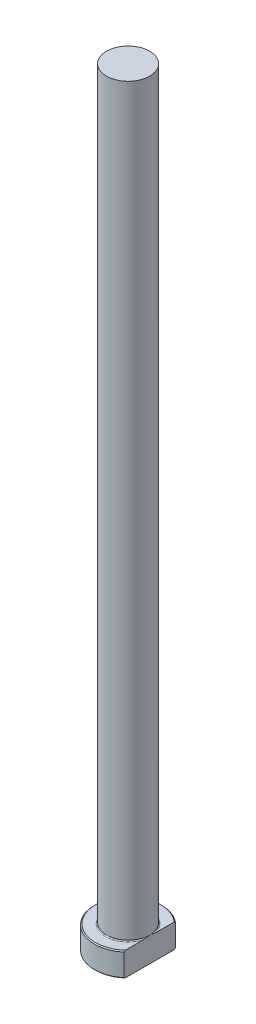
ISO-10303-21;
HEADER;
FILE_DESCRIPTION(('STEP AP214'),'2;1');
FILE_NAME('part.step','',(''),(''),'','','');
FILE_SCHEMA(('AUTOMOTIVE_DESIGN { 1 0 10303 214 1 1 1 1 }'));
ENDSEC;
DATA;
#1=APPLICATION_CONTEXT('core data for automotive mechanical design processes');
#2=APPLICATION_PROTOCOL_DEFINITION('international standard','automotive_design',2000,#1);
#3=PRODUCT_CONTEXT('',#1,'mechanical');
#4=PRODUCT('Part','Part','',(#3));
#5=PRODUCT_RELATED_PRODUCT_CATEGORY('part','',(#4));
#6=PRODUCT_DEFINITION_FORMATION('','',#4);
#7=PRODUCT_DEFINITION_CONTEXT('part definition',#1,'design');
#8=PRODUCT_DEFINITION('design','',#6,#7);
#9=PRODUCT_DEFINITION_SHAPE('','',#8);
#10=(LENGTH_UNIT() NAMED_UNIT(*) SI_UNIT(.MILLI.,.METRE.));
#11=(NAMED_UNIT(*) PLANE_ANGLE_UNIT() SI_UNIT($,.RADIAN.));
#12=(NAMED_UNIT(*) SI_UNIT($,.STERADIAN.) SOLID_ANGLE_UNIT());
#13=UNCERTAINTY_MEASURE_WITH_UNIT(LENGTH_MEASURE(1.E-05),#10,'distance_accuracy_value','');
#14=(GEOMETRIC_REPRESENTATION_CONTEXT(3) GLOBAL_UNCERTAINTY_ASSIGNED_CONTEXT((#13)) GLOBAL_UNIT_ASSIGNED_CONTEXT((#10,
#11,#12)) REPRESENTATION_CONTEXT('',''));
#15=CARTESIAN_POINT('',(0.,0.,0.));
#16=DIRECTION('',(0.,0.,1.));
#17=DIRECTION('',(1.,0.,0.));
#18=AXIS2_PLACEMENT_3D('',#15,#16,#17);
#19=CARTESIAN_POINT('',(0.,0.,0.));
#20=DIRECTION('',(0.,-1.,0.));
#21=DIRECTION('',(0.,0.,-1.));
#22=AXIS2_PLACEMENT_3D('',#19,#20,#21);
#23=PLANE('',#22);
#24=CARTESIAN_POINT('',(0.,0.,0.));
#25=DIRECTION('',(0.,-1.,0.));
#26=DIRECTION('',(0.,0.,-1.));
#27=AXIS2_PLACEMENT_3D('',#24,#25,#26);
#28=CIRCLE('',#27,6.79999999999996);
#29=CARTESIAN_POINT('',(4.49999999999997,0.,5.09803883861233));
#30=VERTEX_POINT('',#29);
#31=CARTESIAN_POINT('',(4.49999999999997,0.,-5.09803883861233));
#32=VERTEX_POINT('',#31);
#33=EDGE_CURVE('E98',#30,#32,#28,.T.);
#34=ORIENTED_EDGE('',*,*,#33,.T.);
#35=DIRECTION('',(0.,0.,1.));
#36=VECTOR('',#35,1.);
#37=CARTESIAN_POINT('',(4.49999999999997,0.,-5.36190264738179));
#38=LINE('',#37,#36);
#39=EDGE_CURVE('E83',#32,#30,#38,.T.);
#40=ORIENTED_EDGE('',*,*,#39,.T.);
#41=EDGE_LOOP('',(#34,#40));
#42=FACE_BOUND('',#41,.T.);
#43=ADVANCED_FACE('F32',(#42),#23,.T.);
#44=CARTESIAN_POINT('',(0.,259.958771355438,0.));
#45=DIRECTION('',(0.,1.,0.));
#46=DIRECTION('',(0.,0.,1.));
#47=AXIS2_PLACEMENT_3D('',#44,#45,#46);
#48=CYLINDRICAL_SURFACE('',#47,6.99999999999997);
#49=CARTESIAN_POINT('',(0.,4.80000000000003,0.));
#50=DIRECTION('',(0.,1.,0.));
#51=DIRECTION('',(0.,0.,1.));
#52=AXIS2_PLACEMENT_3D('',#49,#50,#51);
#53=CIRCLE('',#52,6.99999999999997);
#54=CARTESIAN_POINT('',(4.49999999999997,4.80000000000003,5.36190264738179));
#55=VERTEX_POINT('',#54);
#56=CARTESIAN_POINT('',(4.49999999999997,4.80000000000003,-5.36190264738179));
#57=VERTEX_POINT('',#56);
#58=EDGE_CURVE('E104',#55,#57,#53,.F.);
#59=ORIENTED_EDGE('',*,*,#58,.T.);
#60=DIRECTION('',(0.,-1.,0.));
#61=VECTOR('',#60,1.);
#62=CARTESIAN_POINT('',(4.49999999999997,160.,-5.36190264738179));
#63=LINE('',#62,#61);
#64=CARTESIAN_POINT('',(4.49999999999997,0.200000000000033,-5.36190264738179));
#65=VERTEX_POINT('',#64);
#66=EDGE_CURVE('E183',#57,#65,#63,.T.);
#67=ORIENTED_EDGE('',*,*,#66,.T.);
#68=CARTESIAN_POINT('',(0.,0.200000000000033,0.));
#69=DIRECTION('',(0.,-1.,0.));
#70=DIRECTION('',(0.,0.,-1.));
#71=AXIS2_PLACEMENT_3D('',#68,#69,#70);
#72=CIRCLE('',#71,6.99999999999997);
#73=CARTESIAN_POINT('',(4.49999999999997,0.200000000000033,5.36190264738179));
#74=VERTEX_POINT('',#73);
#75=EDGE_CURVE('E100',#65,#74,#72,.F.);
#76=ORIENTED_EDGE('',*,*,#75,.T.);
#77=DIRECTION('',(0.,-1.,0.));
#78=VECTOR('',#77,1.);
#79=CARTESIAN_POINT('',(4.49999999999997,160.,5.36190264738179));
#80=LINE('',#79,#78);
#81=EDGE_CURVE('E93',#55,#74,#80,.T.);
#82=ORIENTED_EDGE('',*,*,#81,.F.);
#83=EDGE_LOOP('',(#59,#67,#76,#82));
#84=FACE_BOUND('',#83,.T.);
#85=ADVANCED_FACE('F158',(#84),#48,.T.);
#86=CARTESIAN_POINT('',(-6.99999999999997,5.,0.));
#87=DIRECTION('',(0.,1.,0.));
#88=DIRECTION('',(0.,0.,1.));
#89=AXIS2_PLACEMENT_3D('',#86,#87,#88);
#90=PLANE('',#89);
#91=CARTESIAN_POINT('',(0.,5.,0.));
#92=DIRECTION('',(0.,1.,0.));
#93=DIRECTION('',(0.,0.,1.));
#94=AXIS2_PLACEMENT_3D('',#91,#92,#93);
#95=CIRCLE('',#94,6.80000000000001);
#96=CARTESIAN_POINT('',(4.49999999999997,5.,-5.09803883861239));
#97=VERTEX_POINT('',#96);
#98=CARTESIAN_POINT('',(4.49999999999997,5.,5.09803883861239));
#99=VERTEX_POINT('',#98);
#100=EDGE_CURVE('E178',#97,#99,#95,.T.);
#101=ORIENTED_EDGE('',*,*,#100,.T.);
#102=DIRECTION('',(0.,0.,-1.));
#103=VECTOR('',#102,1.);
#104=CARTESIAN_POINT('',(4.49999999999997,5.,0.));
#105=LINE('',#104,#103);
#106=CARTESIAN_POINT('',(4.49999999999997,4.99999999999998,1.35646599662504));
#107=VERTEX_POINT('',#106);
#108=EDGE_CURVE('E57',#99,#107,#105,.T.);
#109=ORIENTED_EDGE('',*,*,#108,.T.);
#110=CARTESIAN_POINT('',(0.,5.,0.));
#111=DIRECTION('',(0.,1.,0.));
#112=DIRECTION('',(0.,0.,1.));
#113=AXIS2_PLACEMENT_3D('',#110,#111,#112);
#114=CIRCLE('',#113,4.69999999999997);
#115=CARTESIAN_POINT('',(4.49999999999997,4.99999999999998,-1.35646599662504));
#116=VERTEX_POINT('',#115);
#117=EDGE_CURVE('E107',#107,#116,#114,.F.);
#118=ORIENTED_EDGE('',*,*,#117,.T.);
#119=EDGE_CURVE('E136',#116,#97,#105,.T.);
#120=ORIENTED_EDGE('',*,*,#119,.T.);
#121=EDGE_LOOP('',(#101,#109,#118,#120));
#122=FACE_BOUND('',#121,.T.);
#123=ADVANCED_FACE('F147',(#122),#90,.T.);
#124=CARTESIAN_POINT('',(0.,5.,0.));
#125=DIRECTION('',(0.,-1.,0.));
#126=DIRECTION('',(0.,0.,-1.));
#127=AXIS2_PLACEMENT_3D('',#124,#125,#126);
#128=CONICAL_SURFACE('',#127,6.8,0.785398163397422);
#129=ORIENTED_EDGE('',*,*,#58,.F.);
#130=CARTESIAN_POINT('',(4.49999999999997,-0.826603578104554,11.7975047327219));
#131=CARTESIAN_POINT('',(4.49999999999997,-0.656533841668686,11.6154797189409));
#132=CARTESIAN_POINT('',(4.49999999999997,-0.486727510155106,11.4332086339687));
#133=CARTESIAN_POINT('',(4.49999999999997,-0.147726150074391,11.0680967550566));
#134=CARTESIAN_POINT('',(4.49999999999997,0.0214688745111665,10.8852559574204));
#135=CARTESIAN_POINT('',(4.49999999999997,0.528086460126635,10.3356799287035));
#136=CARTESIAN_POINT('',(4.49999999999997,0.864461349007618,9.96797672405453));
#137=CARTESIAN_POINT('',(4.49999999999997,1.53592421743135,9.22638843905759));
#138=CARTESIAN_POINT('',(4.49999999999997,1.87098392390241,8.85247771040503));
#139=CARTESIAN_POINT('',(4.49999999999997,2.53567264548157,8.09993899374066));
#140=CARTESIAN_POINT('',(4.49999999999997,2.86530243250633,7.72131168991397));
#141=CARTESIAN_POINT('',(4.49999999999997,3.45461987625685,7.03004475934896));
#142=CARTESIAN_POINT('',(4.49999999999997,3.71567058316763,6.71857295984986));
#143=CARTESIAN_POINT('',(4.49999999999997,4.10171222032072,6.24673895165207));
#144=CARTESIAN_POINT('',(4.49999999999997,4.22949330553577,6.08866046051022));
#145=CARTESIAN_POINT('',(4.49999999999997,4.48278285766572,5.77069538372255));
#146=CARTESIAN_POINT('',(4.49999999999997,4.6082913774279,5.61080884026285));
#147=CARTESIAN_POINT('',(4.49999999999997,4.85630566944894,5.28917357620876));
#148=CARTESIAN_POINT('',(4.49999999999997,4.97881640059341,5.12742868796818));
#149=CARTESIAN_POINT('',(4.49999999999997,5.22038566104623,4.80138722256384));
#150=CARTESIAN_POINT('',(4.49999999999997,5.33944438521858,4.63709079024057));
#151=CARTESIAN_POINT('',(4.49999999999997,5.57315514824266,4.3055112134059));
#152=CARTESIAN_POINT('',(4.49999999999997,5.6878094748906,4.13822968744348));
#153=CARTESIAN_POINT('',(4.49999999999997,5.91154779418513,3.79999593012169));
#154=CARTESIAN_POINT('',(4.49999999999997,6.02063265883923,3.6290442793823));
#155=CARTESIAN_POINT('',(4.49999999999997,6.21658595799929,3.30732260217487));
#156=CARTESIAN_POINT('',(4.49999999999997,6.30440873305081,3.15713645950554));
#157=CARTESIAN_POINT('',(4.49999999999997,6.47332532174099,2.85297503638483));
#158=CARTESIAN_POINT('',(4.49999999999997,6.55441838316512,2.69899933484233));
#159=CARTESIAN_POINT('',(4.49999999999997,6.70797622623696,2.38687180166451));
#160=CARTESIAN_POINT('',(4.49999999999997,6.78044573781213,2.22872231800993));
#161=CARTESIAN_POINT('',(4.49999999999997,6.91445119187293,1.90783021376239));
#162=CARTESIAN_POINT('',(4.49999999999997,6.97598991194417,1.74508877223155));
#163=CARTESIAN_POINT('',(4.49999999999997,7.07411688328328,1.44888794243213));
#164=CARTESIAN_POINT('',(4.49999999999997,7.11323376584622,1.31627139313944));
#165=CARTESIAN_POINT('',(4.49999999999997,7.18128524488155,1.04846462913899));
#166=CARTESIAN_POINT('',(4.49999999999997,7.21022354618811,0.913275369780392));
#167=CARTESIAN_POINT('',(4.49999999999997,7.2564961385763,0.641333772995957));
#168=CARTESIAN_POINT('',(4.49999999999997,7.27386660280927,0.504587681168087));
#169=CARTESIAN_POINT('',(4.49999999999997,7.29619809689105,0.230076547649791));
#170=CARTESIAN_POINT('',(4.49999999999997,7.30115982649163,0.0923115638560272));
#171=CARTESIAN_POINT('',(4.49999999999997,7.29837868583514,-0.183455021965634));
#172=CARTESIAN_POINT('',(4.49999999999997,7.29060196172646,-0.32145627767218));
#173=CARTESIAN_POINT('',(4.49999999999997,7.26273607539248,-0.596199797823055));
#174=CARTESIAN_POINT('',(4.49999999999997,7.24264594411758,-0.732941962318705));
#175=CARTESIAN_POINT('',(4.49999999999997,7.19114637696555,-1.00468961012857));
#176=CARTESIAN_POINT('',(4.49999999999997,7.15970172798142,-1.13968832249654));
#177=CARTESIAN_POINT('',(4.49999999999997,7.08693261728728,-1.40696616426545));
#178=CARTESIAN_POINT('',(4.49999999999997,7.0456076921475,-1.53924516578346));
#179=CARTESIAN_POINT('',(4.49999999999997,6.94926301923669,-1.81615594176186));
#180=CARTESIAN_POINT('',(4.49999999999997,6.89320710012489,-1.96042418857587));
#181=CARTESIAN_POINT('',(4.49999999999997,6.77257673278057,-2.24536359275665));
#182=CARTESIAN_POINT('',(4.49999999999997,6.70799968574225,-2.38603363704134));
#183=CARTESIAN_POINT('',(4.49999999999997,6.57186656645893,-2.66422978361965));
#184=CARTESIAN_POINT('',(4.49999999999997,6.50029866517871,-2.80175005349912));
#185=CARTESIAN_POINT('',(4.49999999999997,6.35162424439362,-3.07372108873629));
#186=CARTESIAN_POINT('',(4.49999999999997,6.27451843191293,-3.2081722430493));
#187=CARTESIAN_POINT('',(4.49999999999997,6.11478562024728,-3.47611571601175));
#188=CARTESIAN_POINT('',(4.49999999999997,6.03209988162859,-3.60957285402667));
#189=CARTESIAN_POINT('',(4.49999999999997,5.86298040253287,-3.87408571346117));
#190=CARTESIAN_POINT('',(4.49999999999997,5.776546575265,-4.00514137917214));
#191=CARTESIAN_POINT('',(4.49999999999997,5.60069241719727,-4.26503919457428));
#192=CARTESIAN_POINT('',(4.49999999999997,5.51127511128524,-4.39388339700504));
#193=CARTESIAN_POINT('',(4.49999999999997,5.32990145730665,-4.64976494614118));
#194=CARTESIAN_POINT('',(4.49999999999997,5.23794514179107,-4.77680231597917));
#195=CARTESIAN_POINT('',(4.49999999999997,5.02845923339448,-5.06114674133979));
#196=CARTESIAN_POINT('',(4.49999999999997,4.91032759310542,-5.21800978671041));
#197=CARTESIAN_POINT('',(4.49999999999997,4.67137262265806,-5.52967502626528));
#198=CARTESIAN_POINT('',(4.49999999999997,4.55054918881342,-5.68447714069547));
#199=CARTESIAN_POINT('',(4.49999999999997,4.18476750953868,-6.14632269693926));
#200=CARTESIAN_POINT('',(4.49999999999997,3.93652718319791,-6.45076612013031));
#201=CARTESIAN_POINT('',(4.49999999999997,3.43375842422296,-7.0549226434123));
#202=CARTESIAN_POINT('',(4.49999999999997,3.17922364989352,-7.35463042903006));
#203=CARTESIAN_POINT('',(4.49999999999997,2.66577175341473,-7.95027689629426));
#204=CARTESIAN_POINT('',(4.49999999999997,2.40685449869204,-8.24621546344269));
#205=CARTESIAN_POINT('',(4.49999999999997,1.90253774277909,-8.81624717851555));
#206=CARTESIAN_POINT('',(4.49999999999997,1.65734104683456,-9.09052019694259));
#207=CARTESIAN_POINT('',(4.49999999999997,1.16472214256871,-9.63707062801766));
#208=CARTESIAN_POINT('',(4.49999999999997,0.917299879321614,-9.90934799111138));
#209=CARTESIAN_POINT('',(4.49999999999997,0.421259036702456,-10.4516873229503));
#210=CARTESIAN_POINT('',(4.49999999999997,0.172644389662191,-10.7217528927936));
#211=CARTESIAN_POINT('',(4.49999999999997,-0.325997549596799,-11.2605533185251));
#212=CARTESIAN_POINT('',(4.49999999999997,-0.576024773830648,-11.5292882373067));
#213=CARTESIAN_POINT('',(4.49999999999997,-0.826603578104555,-11.7975047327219));
#214=B_SPLINE_CURVE_WITH_KNOTS('',3,(#130,#131,#132,#133,#134,#135,#136,#137,#138,#139,#140,
#141,#142,#143,#144,#145,#146,#147,#148,#149,#150,#151,#152,#153,#154,#155,#156,#157,#158,#159,
#160,#161,#162,#163,#164,#165,#166,#167,#168,#169,#170,#171,#172,#173,#174,#175,#176,#177,#178,
#179,#180,#181,#182,#183,#184,#185,#186,#187,#188,#189,#190,#191,#192,#193,#194,#195,#196,#197,
#198,#199,#200,#201,#202,#203,#204,#205,#206,#207,#208,#209,#210,#211,#212,#213),.UNSPECIFIED.,
.F.,.F.,(4,2,2,2,2,2,2,2,2,2,2,2,2,2,2,2,2,2,2,2,2,2,2,2,2,2,2,2,2,2,2,2,2,2,2,2,2,2,2,2,2,4),
(0.,0.747335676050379,1.49467621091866,2.98970927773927,4.49588412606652,6.00184297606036,
7.2209551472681,7.83073509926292,8.44050085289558,9.04917844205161,9.6578216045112,
10.266144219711,10.8743712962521,11.3961742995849,11.9180355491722,12.4396092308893,
12.9610501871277,13.3755059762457,13.789810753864,14.2028138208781,14.6157935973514,
15.029872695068,15.4439843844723,15.8593915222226,16.2748181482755,16.7388057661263,
17.2029352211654,17.6678640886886,18.1327337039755,18.6036459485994,19.0745691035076,
19.5450285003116,20.0154818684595,20.6045534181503,21.1936476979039,22.3719830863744,
23.5515583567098,24.7311693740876,25.8348416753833,26.9385412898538,28.0397632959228,
29.1409327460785),.UNSPECIFIED.);
#215=EDGE_CURVE('E135',#55,#99,#214,.T.);
#216=ORIENTED_EDGE('',*,*,#215,.T.);
#217=ORIENTED_EDGE('',*,*,#100,.F.);
#218=EDGE_CURVE('E127',#97,#57,#214,.T.);
#219=ORIENTED_EDGE('',*,*,#218,.T.);
#220=EDGE_LOOP('',(#129,#216,#217,#219));
#221=FACE_BOUND('',#220,.T.);
#222=ADVANCED_FACE('F143',(#221),#128,.T.);
#223=CARTESIAN_POINT('',(0.,0.200000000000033,0.));
#224=DIRECTION('',(0.,1.,0.));
#225=DIRECTION('',(0.,0.,1.));
#226=AXIS2_PLACEMENT_3D('',#223,#224,#225);
#227=CONICAL_SURFACE('',#226,6.99999999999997,0.785398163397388);
#228=ORIENTED_EDGE('',*,*,#75,.F.);
#229=CARTESIAN_POINT('',(4.49999999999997,5.826603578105,-11.7975047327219));
#230=CARTESIAN_POINT('',(4.49999999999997,5.65653384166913,-11.6154797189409));
#231=CARTESIAN_POINT('',(4.49999999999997,5.48672751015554,-11.4332086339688));
#232=CARTESIAN_POINT('',(4.49999999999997,5.14772615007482,-11.0680967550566));
#233=CARTESIAN_POINT('',(4.49999999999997,4.97853112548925,-10.8852559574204));
#234=CARTESIAN_POINT('',(4.49999999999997,4.47191353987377,-10.3356799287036));
#235=CARTESIAN_POINT('',(4.49999999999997,4.13553865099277,-9.96797672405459));
#236=CARTESIAN_POINT('',(4.49999999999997,3.46407578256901,-9.22638843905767));
#237=CARTESIAN_POINT('',(4.49999999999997,3.12901607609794,-8.85247771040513));
#238=CARTESIAN_POINT('',(4.49999999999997,2.46432735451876,-8.09993899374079));
#239=CARTESIAN_POINT('',(4.49999999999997,2.13469756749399,-7.72131168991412));
#240=CARTESIAN_POINT('',(4.49999999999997,1.54538012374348,-7.03004475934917));
#241=CARTESIAN_POINT('',(4.49999999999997,1.28432941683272,-6.71857295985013));
#242=CARTESIAN_POINT('',(4.49999999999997,0.898287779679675,-6.24673895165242));
#243=CARTESIAN_POINT('',(4.49999999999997,0.770506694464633,-6.08866046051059));
#244=CARTESIAN_POINT('',(4.49999999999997,0.517217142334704,-5.77069538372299));
#245=CARTESIAN_POINT('',(4.49999999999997,0.391708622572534,-5.61080884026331));
#246=CARTESIAN_POINT('',(4.49999999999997,0.14369433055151,-5.28917357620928));
#247=CARTESIAN_POINT('',(4.49999999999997,0.0211835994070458,-5.12742868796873));
#248=CARTESIAN_POINT('',(4.49999999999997,-0.220385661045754,-4.80138722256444));
#249=CARTESIAN_POINT('',(4.49999999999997,-0.339444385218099,-4.63709079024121));
#250=CARTESIAN_POINT('',(4.49999999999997,-0.573155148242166,-4.3055112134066));
#251=CARTESIAN_POINT('',(4.49999999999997,-0.687809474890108,-4.13822968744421));
#252=CARTESIAN_POINT('',(4.49999999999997,-0.91154779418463,-3.79999593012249));
#253=CARTESIAN_POINT('',(4.49999999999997,-1.02063265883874,-3.62904427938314));
#254=CARTESIAN_POINT('',(4.49999999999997,-1.21658595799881,-3.30732260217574));
#255=CARTESIAN_POINT('',(4.49999999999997,-1.30440873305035,-3.15713645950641));
#256=CARTESIAN_POINT('',(4.49999999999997,-1.47332532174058,-2.85297503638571));
#257=CARTESIAN_POINT('',(4.49999999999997,-1.55441838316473,-2.6989993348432));
#258=CARTESIAN_POINT('',(4.49999999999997,-1.70797622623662,-2.38687180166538));
#259=CARTESIAN_POINT('',(4.49999999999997,-1.78044573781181,-2.22872231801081));
#260=CARTESIAN_POINT('',(4.49999999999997,-1.91445119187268,-1.90783021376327));
#261=CARTESIAN_POINT('',(4.49999999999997,-1.97598991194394,-1.74508877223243));
#262=CARTESIAN_POINT('',(4.49999999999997,-2.0741168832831,-1.44888794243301));
#263=CARTESIAN_POINT('',(4.49999999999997,-2.11323376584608,-1.31627139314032));
#264=CARTESIAN_POINT('',(4.49999999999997,-2.18128524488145,-1.04846462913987));
#265=CARTESIAN_POINT('',(4.49999999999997,-2.21022354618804,-0.913275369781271));
#266=CARTESIAN_POINT('',(4.49999999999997,-2.25649613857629,-0.641333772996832));
#267=CARTESIAN_POINT('',(4.49999999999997,-2.27386660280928,-0.504587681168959));
#268=CARTESIAN_POINT('',(4.49999999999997,-2.29619809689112,-0.230076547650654));
#269=CARTESIAN_POINT('',(4.49999999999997,-2.30115982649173,-0.0923115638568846));
#270=CARTESIAN_POINT('',(4.49999999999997,-2.29837868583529,0.183455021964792));
#271=CARTESIAN_POINT('',(4.49999999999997,-2.29060196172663,0.321456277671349));
#272=CARTESIAN_POINT('',(4.49999999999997,-2.2627360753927,0.596199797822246));
#273=CARTESIAN_POINT('',(4.49999999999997,-2.24264594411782,0.732941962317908));
#274=CARTESIAN_POINT('',(4.49999999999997,-2.19114637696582,1.0046896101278));
#275=CARTESIAN_POINT('',(4.49999999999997,-2.15970172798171,1.13968832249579));
#276=CARTESIAN_POINT('',(4.49999999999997,-2.0869326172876,1.40696616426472));
#277=CARTESIAN_POINT('',(4.49999999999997,-2.04560769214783,1.53924516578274));
#278=CARTESIAN_POINT('',(4.49999999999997,-1.94926301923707,1.81615594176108));
#279=CARTESIAN_POINT('',(4.49999999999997,-1.89320710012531,1.96042418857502));
#280=CARTESIAN_POINT('',(4.49999999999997,-1.77257673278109,2.24536359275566));
#281=CARTESIAN_POINT('',(4.49999999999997,-1.70799968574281,2.38603363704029));
#282=CARTESIAN_POINT('',(4.49999999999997,-1.57186656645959,2.66422978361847));
#283=CARTESIAN_POINT('',(4.49999999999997,-1.50029866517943,2.80175005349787));
#284=CARTESIAN_POINT('',(4.49999999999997,-1.35162424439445,3.07372108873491));
#285=CARTESIAN_POINT('',(4.49999999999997,-1.2745184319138,3.20817224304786));
#286=CARTESIAN_POINT('',(4.49999999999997,-1.11478562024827,3.47611571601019));
#287=CARTESIAN_POINT('',(4.49999999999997,-1.03209988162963,3.60957285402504));
#288=CARTESIAN_POINT('',(4.49999999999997,-0.862980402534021,3.87408571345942));
#289=CARTESIAN_POINT('',(4.49999999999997,-0.776546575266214,4.00514137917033));
#290=CARTESIAN_POINT('',(4.49999999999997,-0.600692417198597,4.26503919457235));
#291=CARTESIAN_POINT('',(4.49999999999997,-0.511275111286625,4.39388339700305));
#292=CARTESIAN_POINT('',(4.49999999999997,-0.329901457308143,4.64976494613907));
#293=CARTESIAN_POINT('',(4.49999999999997,-0.237945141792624,4.776802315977));
#294=CARTESIAN_POINT('',(4.49999999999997,-0.0284592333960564,5.06114674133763));
#295=CARTESIAN_POINT('',(4.49999999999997,0.0896724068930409,5.2180097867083));
#296=CARTESIAN_POINT('',(4.49999999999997,0.328627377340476,5.5296750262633));
#297=CARTESIAN_POINT('',(4.49999999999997,0.44945081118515,5.68447714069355));
#298=CARTESIAN_POINT('',(4.49999999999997,0.815232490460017,6.14632269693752));
#299=CARTESIAN_POINT('',(4.49999999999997,1.06347281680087,6.45076612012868));
#300=CARTESIAN_POINT('',(4.49999999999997,1.56624157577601,7.05492264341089));
#301=CARTESIAN_POINT('',(4.49999999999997,1.82077635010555,7.35463042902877));
#302=CARTESIAN_POINT('',(4.49999999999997,2.33422824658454,7.95027689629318));
#303=CARTESIAN_POINT('',(4.49999999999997,2.59314550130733,8.24621546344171));
#304=CARTESIAN_POINT('',(4.49999999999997,3.09746225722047,8.81624717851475));
#305=CARTESIAN_POINT('',(4.49999999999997,3.34265895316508,9.09052019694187));
#306=CARTESIAN_POINT('',(4.49999999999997,3.83527785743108,9.63707062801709));
#307=CARTESIAN_POINT('',(4.49999999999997,4.08270012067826,9.90934799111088));
#308=CARTESIAN_POINT('',(4.49999999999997,4.57874096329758,10.4516873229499));
#309=CARTESIAN_POINT('',(4.49999999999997,4.82735561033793,10.7217528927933));
#310=CARTESIAN_POINT('',(4.49999999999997,5.32599754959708,11.260553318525));
#311=CARTESIAN_POINT('',(4.49999999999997,5.57602477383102,11.5292882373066));
#312=CARTESIAN_POINT('',(4.49999999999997,5.82660357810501,11.7975047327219));
#313=B_SPLINE_CURVE_WITH_KNOTS('',3,(#229,#230,#231,#232,#233,#234,#235,#236,#237,#238,#239,
#240,#241,#242,#243,#244,#245,#246,#247,#248,#249,#250,#251,#252,#253,#254,#255,#256,#257,#258,
#259,#260,#261,#262,#263,#264,#265,#266,#267,#268,#269,#270,#271,#272,#273,#274,#275,#276,#277,
#278,#279,#280,#281,#282,#283,#284,#285,#286,#287,#288,#289,#290,#291,#292,#293,#294,#295,#296,
#297,#298,#299,#300,#301,#302,#303,#304,#305,#306,#307,#308,#309,#310,#311,#312),.UNSPECIFIED.,
.F.,.F.,(4,2,2,2,2,2,2,2,2,2,2,2,2,2,2,2,2,2,2,2,2,2,2,2,2,2,2,2,2,2,2,2,2,2,2,2,2,2,2,2,2,4),
(0.,0.747335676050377,1.49467621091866,2.98970927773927,4.49588412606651,6.00184297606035,
7.22095514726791,7.83073509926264,8.44050085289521,9.04917844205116,9.65782160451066,
10.2661442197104,10.8743712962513,11.3961742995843,11.9180355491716,12.4396092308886,
12.9610501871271,13.3755059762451,13.7898107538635,14.2028138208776,14.6157935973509,
15.0298726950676,15.4439843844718,15.8593915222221,16.2748181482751,16.7388057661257,
17.2029352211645,17.6678640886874,18.1327337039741,18.6036459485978,19.0745691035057,
19.5450285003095,20.0154818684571,20.6045534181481,21.1936476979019,22.3719830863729,
23.5515583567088,24.7311693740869,25.834841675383,26.9385412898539,28.0397632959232,
29.1409327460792),.UNSPECIFIED.);
#314=EDGE_CURVE('E86',#65,#32,#313,.T.);
#315=ORIENTED_EDGE('',*,*,#314,.T.);
#316=ORIENTED_EDGE('',*,*,#33,.F.);
#317=EDGE_CURVE('E89',#30,#74,#313,.T.);
#318=ORIENTED_EDGE('',*,*,#317,.T.);
#319=EDGE_LOOP('',(#228,#315,#316,#318));
#320=FACE_BOUND('',#319,.T.);
#321=ADVANCED_FACE('F97',(#320),#227,.T.);
#322=CARTESIAN_POINT('',(0.,5.19999999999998,0.));
#323=DIRECTION('',(0.,1.,0.));
#324=DIRECTION('',(0.,0.,1.));
#325=AXIS2_PLACEMENT_3D('',#322,#323,#324);
#326=TOROIDAL_SURFACE('',#325,4.69999999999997,0.2);
#327=CARTESIAN_POINT('',(4.49999999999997,5.19999999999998,0.));
#328=CARTESIAN_POINT('',(4.49999999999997,5.20000055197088,-6.82190207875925E-09));
#329=CARTESIAN_POINT('',(4.49999999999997,5.20000110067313,-2.8507749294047E-07));
#330=CARTESIAN_POINT('',(4.49999999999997,5.20000211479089,-1.011869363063E-06));
#331=CARTESIAN_POINT('',(4.49999999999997,5.20000255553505,-1.47962814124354E-06));
#332=CARTESIAN_POINT('',(4.49999999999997,5.20000349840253,-2.60944744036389E-06));
#333=CARTESIAN_POINT('',(4.49999999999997,5.2000039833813,-3.28932128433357E-06));
#334=CARTESIAN_POINT('',(4.49999999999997,5.20000482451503,-4.67191774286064E-06));
#335=CARTESIAN_POINT('',(4.49999999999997,5.20000518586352,-5.37183781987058E-06));
#336=CARTESIAN_POINT('',(4.49999999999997,5.2000065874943,-8.170073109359E-06));
#337=CARTESIAN_POINT('',(4.49999999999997,5.2000075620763,-1.03053692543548E-05));
#338=CARTESIAN_POINT('',(4.49999999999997,5.20000909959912,-1.44577153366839E-05));
#339=CARTESIAN_POINT('',(4.49999999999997,5.20000969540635,-1.64630059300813E-05));
#340=CARTESIAN_POINT('',(4.49999999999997,5.20001228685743,-2.51554967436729E-05));
#341=CARTESIAN_POINT('',(4.49999999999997,5.20001430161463,-3.18381715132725E-05));
#342=CARTESIAN_POINT('',(4.49999999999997,5.20001716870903,-4.42838289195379E-05));
#343=CARTESIAN_POINT('',(4.49999999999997,5.20001815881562,-5.00144685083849E-05));
#344=CARTESIAN_POINT('',(4.49999999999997,5.20002543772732,-9.26835273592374E-05));
#345=CARTESIAN_POINT('',(4.49999999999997,5.20003122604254,-0.000129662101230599));
#346=CARTESIAN_POINT('',(4.49999999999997,5.20005596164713,-0.000272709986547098));
#347=CARTESIAN_POINT('',(4.49999999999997,5.20007919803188,-0.00037804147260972));
#348=CARTESIAN_POINT('',(4.49999999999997,5.20016600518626,-0.000777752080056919));
#349=CARTESIAN_POINT('',(4.49999999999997,5.2002271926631,-0.00107246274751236));
#350=CARTESIAN_POINT('',(4.49999999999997,5.20046266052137,-0.00220073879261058));
#351=CARTESIAN_POINT('',(4.49999999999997,5.20063910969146,-0.00303403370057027));
#352=CARTESIAN_POINT('',(4.49999999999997,5.20146807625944,-0.00695397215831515));
#353=CARTESIAN_POINT('',(4.49999999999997,5.20211775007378,-0.0100409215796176));
#354=CARTESIAN_POINT('',(4.49999999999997,5.2104625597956,-0.0496851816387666));
#355=CARTESIAN_POINT('',(4.49999999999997,5.2181721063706,-0.0862414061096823));
#356=CARTESIAN_POINT('',(4.49999999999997,5.23425793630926,-0.163016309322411));
#357=CARTESIAN_POINT('',(4.49999999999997,5.24262411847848,-0.203237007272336));
#358=CARTESIAN_POINT('',(4.49999999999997,5.25647489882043,-0.270691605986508));
#359=CARTESIAN_POINT('',(4.49999999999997,5.26201543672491,-0.297913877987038));
#360=CARTESIAN_POINT('',(4.49999999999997,5.27283497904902,-0.351731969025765));
#361=CARTESIAN_POINT('',(4.49999999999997,5.27811706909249,-0.378327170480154));
#362=CARTESIAN_POINT('',(4.49999999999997,5.29540054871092,-0.466700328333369));
#363=CARTESIAN_POINT('',(4.49999999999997,5.30706090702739,-0.528546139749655));
#364=CARTESIAN_POINT('',(4.49999999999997,5.32919553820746,-0.652993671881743));
#365=CARTESIAN_POINT('',(4.49999999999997,5.33965890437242,-0.715597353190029));
#366=CARTESIAN_POINT('',(4.49999999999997,5.35981150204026,-0.848050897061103));
#367=CARTESIAN_POINT('',(4.49999999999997,5.36928619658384,-0.917934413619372));
#368=CARTESIAN_POINT('',(4.49999999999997,5.38501179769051,-1.05789403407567));
#369=CARTESIAN_POINT('',(4.49999999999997,5.39127087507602,-1.12796919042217));
#370=CARTESIAN_POINT('',(4.49999999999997,5.39912931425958,-1.26576099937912));
#371=CARTESIAN_POINT('',(4.49999999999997,5.40089657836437,-1.33346617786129));
#372=CARTESIAN_POINT('',(4.49999999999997,5.39892238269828,-1.43427893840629));
#373=CARTESIAN_POINT('',(4.49999999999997,5.39752994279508,-1.46742827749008));
#374=CARTESIAN_POINT('',(4.49999999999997,5.39286046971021,-1.53357775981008));
#375=CARTESIAN_POINT('',(4.49999999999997,5.38958468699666,-1.56657798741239));
#376=CARTESIAN_POINT('',(4.49999999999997,5.38053340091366,-1.63263406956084));
#377=CARTESIAN_POINT('',(4.49999999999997,5.37473096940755,-1.66568659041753));
#378=CARTESIAN_POINT('',(4.49999999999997,5.363351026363,-1.71471614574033));
#379=CARTESIAN_POINT('',(4.49999999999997,5.35910046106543,-1.73099981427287));
#380=CARTESIAN_POINT('',(4.49999999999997,5.34948134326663,-1.76322922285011));
#381=CARTESIAN_POINT('',(4.49999999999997,5.34411369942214,-1.77917522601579));
#382=CARTESIAN_POINT('',(4.49999999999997,5.33191498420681,-1.81057972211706));
#383=CARTESIAN_POINT('',(4.49999999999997,5.32507796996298,-1.82603593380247));
#384=CARTESIAN_POINT('',(4.49999999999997,5.30945990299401,-1.85590044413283));
#385=CARTESIAN_POINT('',(4.49999999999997,5.3006900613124,-1.87031417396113));
#386=CARTESIAN_POINT('',(4.49999999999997,5.28636937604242,-1.88912645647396));
#387=CARTESIAN_POINT('',(4.49999999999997,5.28198345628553,-1.89440539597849));
#388=CARTESIAN_POINT('',(4.49999999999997,5.27265048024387,-1.90446776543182));
#389=CARTESIAN_POINT('',(4.49999999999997,5.26770253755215,-1.90925038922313));
#390=CARTESIAN_POINT('',(4.49999999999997,5.25711045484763,-1.91814546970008));
#391=CARTESIAN_POINT('',(4.49999999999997,5.25145790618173,-1.92224813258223));
#392=CARTESIAN_POINT('',(4.49999999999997,5.23949451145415,-1.92934216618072));
#393=CARTESIAN_POINT('',(4.49999999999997,5.23318629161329,-1.93233776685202));
#394=CARTESIAN_POINT('',(4.49999999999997,5.22225980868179,-1.93605363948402));
#395=CARTESIAN_POINT('',(4.49999999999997,5.21778688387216,-1.93720033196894));
#396=CARTESIAN_POINT('',(4.49999999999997,5.20871133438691,-1.93872266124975));
#397=CARTESIAN_POINT('',(4.49999999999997,5.20410881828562,-1.9390989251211));
#398=CARTESIAN_POINT('',(4.49999999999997,5.19490368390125,-1.939041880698));
#399=CARTESIAN_POINT('',(4.49999999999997,5.19030107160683,-1.93860763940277));
#400=CARTESIAN_POINT('',(4.49999999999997,5.18123418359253,-1.93697295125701));
#401=CARTESIAN_POINT('',(4.49999999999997,5.17677002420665,-1.93577187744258));
#402=CARTESIAN_POINT('',(4.49999999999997,5.1668471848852,-1.93227382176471));
#403=CARTESIAN_POINT('',(4.49999999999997,5.16146458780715,-1.92976289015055));
#404=CARTESIAN_POINT('',(4.49999999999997,5.15117210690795,-1.92391275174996));
#405=CARTESIAN_POINT('',(4.49999999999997,5.1462632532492,-1.92057179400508));
#406=CARTESIAN_POINT('',(4.49999999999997,5.13406500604,-1.91106955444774));
#407=CARTESIAN_POINT('',(4.49999999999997,5.1271509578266,-1.90443135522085));
#408=CARTESIAN_POINT('',(4.49999999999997,5.1143641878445,-1.89022781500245));
#409=CARTESIAN_POINT('',(4.49999999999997,5.10849431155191,-1.88266003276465));
#410=CARTESIAN_POINT('',(4.49999999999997,5.09196345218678,-1.85885313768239));
#411=CARTESIAN_POINT('',(4.49999999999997,5.08260528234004,-1.84172098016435));
#412=CARTESIAN_POINT('',(4.49999999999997,5.0661847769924,-1.80641645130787));
#413=CARTESIAN_POINT('',(4.49999999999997,5.05912924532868,-1.78824118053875));
#414=CARTESIAN_POINT('',(4.49999999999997,5.04323663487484,-1.74113187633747));
#415=CARTESIAN_POINT('',(4.49999999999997,5.03557186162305,-1.7118061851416));
#416=CARTESIAN_POINT('',(4.49999999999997,5.02293045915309,-1.6525641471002));
#417=CARTESIAN_POINT('',(4.49999999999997,5.01795986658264,-1.62264662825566));
#418=CARTESIAN_POINT('',(4.49999999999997,5.01001791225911,-1.56241066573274));
#419=CARTESIAN_POINT('',(4.49999999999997,5.00705603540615,-1.53209099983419));
#420=CARTESIAN_POINT('',(4.49999999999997,5.00272853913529,-1.4713805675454));
#421=CARTESIAN_POINT('',(4.49999999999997,5.00136115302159,-1.44098991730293));
#422=CARTESIAN_POINT('',(4.49999999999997,4.99922532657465,-1.3517640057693));
#423=CARTESIAN_POINT('',(4.49999999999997,5.00021079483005,-1.29288773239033));
#424=CARTESIAN_POINT('',(4.49999999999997,5.00555979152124,-1.17527759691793));
#425=CARTESIAN_POINT('',(4.49999999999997,5.0099258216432,-1.11654387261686));
#426=CARTESIAN_POINT('',(4.49999999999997,5.02118223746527,-0.999199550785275));
#427=CARTESIAN_POINT('',(4.49999999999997,5.02807797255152,-0.940589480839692));
#428=CARTESIAN_POINT('',(4.49999999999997,5.04376271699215,-0.823619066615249));
#429=CARTESIAN_POINT('',(4.49999999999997,5.05255207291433,-0.765258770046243));
#430=CARTESIAN_POINT('',(4.49999999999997,5.08097305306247,-0.59074120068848));
#431=CARTESIAN_POINT('',(4.49999999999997,5.10268261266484,-0.474928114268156));
#432=CARTESIAN_POINT('',(4.49999999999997,5.14864719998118,-0.243827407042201));
#433=CARTESIAN_POINT('',(4.49999999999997,5.1729024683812,-0.128539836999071));
#434=CARTESIAN_POINT('',(4.49999999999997,5.19721381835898,-0.013216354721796));
#435=CARTESIAN_POINT('',(4.49999999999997,5.19722314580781,-0.0131721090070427));
#436=CARTESIAN_POINT('',(4.49999999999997,5.19779043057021,-0.0104809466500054));
#437=CARTESIAN_POINT('',(4.49999999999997,5.19834611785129,-0.00783370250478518));
#438=CARTESIAN_POINT('',(4.49999999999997,5.19915446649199,-0.00401576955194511));
#439=CARTESIAN_POINT('',(4.49999999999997,5.19940338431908,-0.00284453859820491));
#440=CARTESIAN_POINT('',(4.49999999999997,5.19972657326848,-0.00129224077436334));
#441=CARTESIAN_POINT('',(4.49999999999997,5.19980524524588,-0.000911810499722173));
#442=CARTESIAN_POINT('',(4.49999999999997,5.19991316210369,-0.000412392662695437));
#443=CARTESIAN_POINT('',(4.49999999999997,5.199939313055,-0.000292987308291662));
#444=CARTESIAN_POINT('',(4.49999999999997,5.19996676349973,-0.000133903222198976));
#445=CARTESIAN_POINT('',(4.49999999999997,5.19997289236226,-9.50488513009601E-05));
#446=CARTESIAN_POINT('',(4.49999999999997,5.19998085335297,-5.04499399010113E-05));
#447=CARTESIAN_POINT('',(4.49999999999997,5.19998191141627,-4.46245658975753E-05));
#448=CARTESIAN_POINT('',(4.49999999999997,5.19998498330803,-3.19756841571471E-05));
#449=CARTESIAN_POINT('',(4.49999999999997,5.19998714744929,-2.518933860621E-05));
#450=CARTESIAN_POINT('',(4.49999999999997,5.19998992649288,-1.63868871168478E-05));
#451=CARTESIAN_POINT('',(4.49999999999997,5.19999055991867,-1.43745410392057E-05));
#452=CARTESIAN_POINT('',(4.49999999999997,5.19999218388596,-1.02133648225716E-05));
#453=CARTESIAN_POINT('',(4.49999999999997,5.19999320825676,-8.07729849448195E-06));
#454=CARTESIAN_POINT('',(4.49999999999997,5.19999467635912,-5.28414581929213E-06));
#455=CARTESIAN_POINT('',(4.49999999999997,5.19999505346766,-4.58771677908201E-06));
#456=CARTESIAN_POINT('',(4.49999999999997,5.19999592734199,-3.21494462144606E-06));
#457=CARTESIAN_POINT('',(4.49999999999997,5.19999642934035,-2.5415638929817E-06));
#458=CARTESIAN_POINT('',(4.49999999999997,5.19999740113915,-1.42657027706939E-06));
#459=CARTESIAN_POINT('',(4.49999999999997,5.19999785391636,-9.66495650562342E-07));
#460=CARTESIAN_POINT('',(4.49999999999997,5.19999888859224,-2.59794050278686E-07));
#461=CARTESIAN_POINT('',(4.49999999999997,5.19999944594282,6.84768658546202E-09));
#462=CARTESIAN_POINT('',(4.49999999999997,5.19999999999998,0.));
#463=B_SPLINE_CURVE_WITH_KNOTS('',3,(#327,#328,#329,#330,#331,#332,#333,#334,#335,#336,#337,
#338,#339,#340,#341,#342,#343,#344,#345,#346,#347,#348,#349,#350,#351,#352,#353,#354,#355,#356,
#357,#358,#359,#360,#361,#362,#363,#364,#365,#366,#367,#368,#369,#370,#371,#372,#373,#374,#375,
#376,#377,#378,#379,#380,#381,#382,#383,#384,#385,#386,#387,#388,#389,#390,#391,#392,#393,#394,
#395,#396,#397,#398,#399,#400,#401,#402,#403,#404,#405,#406,#407,#408,#409,#410,#411,#412,#413,
#414,#415,#416,#417,#418,#419,#420,#421,#422,#423,#424,#425,#426,#427,#428,#429,#430,#431,#432,
#433,#434,#435,#436,#437,#438,#439,#440,#441,#442,#443,#444,#445,#446,#447,#448,#449,#450,#451,
#452,#453,#454,#455,#456,#457,#458,#459,#460,#461,#462),.UNSPECIFIED.,.T.,.F.,(4,2,2,2,2,2,2,2,
2,2,2,2,2,2,2,2,2,2,2,2,2,2,2,2,2,2,2,2,2,2,2,2,2,2,2,2,2,2,2,2,2,2,2,2,2,2,2,2,2,2,2,2,2,2,2,2,
2,2,2,2,2,2,2,2,2,2,2,4),(0.,1.69150264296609E-06,3.63558631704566E-06,6.12166225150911E-06,
8.48452135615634E-06,1.55048842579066E-05,2.17748008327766E-05,4.26896425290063E-05,
6.01187537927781E-05,0.000172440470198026,0.000495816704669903,0.00139901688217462,
0.00395409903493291,0.0134181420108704,0.125496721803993,0.248741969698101,0.332082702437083,
0.413426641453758,0.602223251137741,0.792622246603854,1.00413639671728,1.21511040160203,
1.4180738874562,1.51756782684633,1.61699578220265,1.71751038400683,1.76796997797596,
1.81838868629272,1.86901528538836,1.9193556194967,1.9399151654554,1.96050759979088,
1.98137480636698,2.0021614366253,2.01595568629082,2.0297387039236,2.04353759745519,
2.05734778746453,2.0750662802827,2.0928224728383,2.12141432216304,2.1500829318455,
2.20832061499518,2.26672885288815,2.35743544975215,2.44834445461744,2.53967978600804,
2.63091382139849,2.80740805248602,2.98403301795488,3.1610336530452,3.33806671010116,
3.69147200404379,4.04491074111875,4.04504639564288,4.0531616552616,4.0567534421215,
4.05791916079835,4.0582856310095,4.05840367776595,4.058421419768,4.0584427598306,
4.05844908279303,4.05845616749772,4.05845854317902,4.05846104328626,4.05846299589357,
4.05846469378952),.UNSPECIFIED.);
#464=CARTESIAN_POINT('',(4.49999999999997,5.19999999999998,0.));
#465=VERTEX_POINT('',#464);
#466=EDGE_CURVE('E11',#116,#465,#463,.T.);
#467=ORIENTED_EDGE('',*,*,#466,.F.);
#468=ORIENTED_EDGE('',*,*,#117,.F.);
#469=CARTESIAN_POINT('',(4.49999999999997,5.19999999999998,0.));
#470=CARTESIAN_POINT('',(4.49999999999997,5.19999944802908,6.82190212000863E-09));
#471=CARTESIAN_POINT('',(4.49999999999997,5.19999889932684,2.85077492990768E-07));
#472=CARTESIAN_POINT('',(4.49999999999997,5.19999788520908,1.01186936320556E-06));
#473=CARTESIAN_POINT('',(4.49999999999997,5.19999744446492,1.47962814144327E-06));
#474=CARTESIAN_POINT('',(4.49999999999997,5.19999650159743,2.60944744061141E-06));
#475=CARTESIAN_POINT('',(4.49999999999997,5.19999601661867,3.28932128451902E-06));
#476=CARTESIAN_POINT('',(4.49999999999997,5.19999517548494,4.6719177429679E-06));
#477=CARTESIAN_POINT('',(4.49999999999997,5.19999481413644,5.3718378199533E-06));
#478=CARTESIAN_POINT('',(4.49999999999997,5.19999341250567,8.17007310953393E-06));
#479=CARTESIAN_POINT('',(4.49999999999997,5.19999243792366,1.03053692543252E-05));
#480=CARTESIAN_POINT('',(4.49999999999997,5.19999090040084,1.44577153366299E-05));
#481=CARTESIAN_POINT('',(4.49999999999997,5.19999030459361,1.64630059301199E-05));
#482=CARTESIAN_POINT('',(4.49999999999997,5.19998771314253,2.51554967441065E-05));
#483=CARTESIAN_POINT('',(4.49999999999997,5.19998569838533,3.18381715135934E-05));
#484=CARTESIAN_POINT('',(4.49999999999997,5.19998283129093,4.42838289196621E-05));
#485=CARTESIAN_POINT('',(4.49999999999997,5.19998184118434,5.0014468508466E-05));
#486=CARTESIAN_POINT('',(4.49999999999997,5.19997456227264,9.2683527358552E-05));
#487=CARTESIAN_POINT('',(4.49999999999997,5.19996877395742,0.000129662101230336));
#488=CARTESIAN_POINT('',(4.49999999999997,5.19994403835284,0.000272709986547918));
#489=CARTESIAN_POINT('',(4.49999999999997,5.19992080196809,0.000378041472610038));
#490=CARTESIAN_POINT('',(4.49999999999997,5.1998339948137,0.000777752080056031));
#491=CARTESIAN_POINT('',(4.49999999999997,5.19977280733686,0.00107246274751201));
#492=CARTESIAN_POINT('',(4.49999999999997,5.1995373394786,0.00220073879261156));
#493=CARTESIAN_POINT('',(4.49999999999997,5.1993608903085,0.00303403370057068));
#494=CARTESIAN_POINT('',(4.49999999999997,5.19853192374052,0.00695397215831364));
#495=CARTESIAN_POINT('',(4.49999999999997,5.19788224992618,0.0100409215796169));
#496=CARTESIAN_POINT('',(4.49999999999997,5.18953744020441,0.0496851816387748));
#497=CARTESIAN_POINT('',(4.49999999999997,5.18182789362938,0.0862414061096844));
#498=CARTESIAN_POINT('',(4.49999999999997,5.16574206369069,0.163016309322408));
#499=CARTESIAN_POINT('',(4.49999999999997,5.15737588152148,0.203237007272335));
#500=CARTESIAN_POINT('',(4.49999999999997,5.14352510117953,0.270691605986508));
#501=CARTESIAN_POINT('',(4.49999999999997,5.13798456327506,0.297913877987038));
#502=CARTESIAN_POINT('',(4.49999999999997,5.12716502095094,0.351731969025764));
#503=CARTESIAN_POINT('',(4.49999999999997,5.12188293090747,0.378327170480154));
#504=CARTESIAN_POINT('',(4.49999999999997,5.10459945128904,0.466700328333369));
#505=CARTESIAN_POINT('',(4.49999999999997,5.09293909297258,0.528546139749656));
#506=CARTESIAN_POINT('',(4.49999999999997,5.0708044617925,0.652993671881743));
#507=CARTESIAN_POINT('',(4.49999999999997,5.06034109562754,0.715597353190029));
#508=CARTESIAN_POINT('',(4.49999999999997,5.0401884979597,0.848050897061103));
#509=CARTESIAN_POINT('',(4.49999999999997,5.03071380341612,0.917934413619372));
#510=CARTESIAN_POINT('',(4.49999999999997,5.01498820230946,1.05789403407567));
#511=CARTESIAN_POINT('',(4.49999999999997,5.00872912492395,1.12796919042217));
#512=CARTESIAN_POINT('',(4.49999999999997,5.00087068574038,1.26576099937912));
#513=CARTESIAN_POINT('',(4.49999999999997,4.9991034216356,1.33346617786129));
#514=CARTESIAN_POINT('',(4.49999999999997,5.00107761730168,1.43427893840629));
#515=CARTESIAN_POINT('',(4.49999999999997,5.00247005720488,1.46742827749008));
#516=CARTESIAN_POINT('',(4.49999999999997,5.00713953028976,1.53357775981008));
#517=CARTESIAN_POINT('',(4.49999999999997,5.0104153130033,1.56657798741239));
#518=CARTESIAN_POINT('',(4.49999999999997,5.0194665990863,1.63263406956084));
#519=CARTESIAN_POINT('',(4.49999999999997,5.02526903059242,1.66568659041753));
#520=CARTESIAN_POINT('',(4.49999999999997,5.03664897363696,1.71471614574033));
#521=CARTESIAN_POINT('',(4.49999999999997,5.04089953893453,1.73099981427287));
#522=CARTESIAN_POINT('',(4.49999999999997,5.05051865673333,1.76322922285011));
#523=CARTESIAN_POINT('',(4.49999999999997,5.05588630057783,1.77917522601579));
#524=CARTESIAN_POINT('',(4.49999999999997,5.06808501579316,1.81057972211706));
#525=CARTESIAN_POINT('',(4.49999999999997,5.07492203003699,1.82603593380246));
#526=CARTESIAN_POINT('',(4.49999999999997,5.09054009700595,1.85590044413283));
#527=CARTESIAN_POINT('',(4.49999999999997,5.09930993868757,1.87031417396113));
#528=CARTESIAN_POINT('',(4.49999999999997,5.11363062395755,1.88912645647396));
#529=CARTESIAN_POINT('',(4.49999999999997,5.11801654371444,1.89440539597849));
#530=CARTESIAN_POINT('',(4.49999999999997,5.12734951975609,1.90446776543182));
#531=CARTESIAN_POINT('',(4.49999999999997,5.13229746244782,1.90925038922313));
#532=CARTESIAN_POINT('',(4.49999999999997,5.14288954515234,1.91814546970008));
#533=CARTESIAN_POINT('',(4.49999999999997,5.14854209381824,1.92224813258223));
#534=CARTESIAN_POINT('',(4.49999999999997,5.16050548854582,1.92934216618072));
#535=CARTESIAN_POINT('',(4.49999999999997,5.16681370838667,1.93233776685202));
#536=CARTESIAN_POINT('',(4.49999999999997,5.17774019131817,1.93605363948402));
#537=CARTESIAN_POINT('',(4.49999999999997,5.18221311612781,1.93720033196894));
#538=CARTESIAN_POINT('',(4.49999999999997,5.19128866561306,1.93872266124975));
#539=CARTESIAN_POINT('',(4.49999999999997,5.19589118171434,1.9390989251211));
#540=CARTESIAN_POINT('',(4.49999999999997,5.20509631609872,1.939041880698));
#541=CARTESIAN_POINT('',(4.49999999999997,5.20969892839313,1.93860763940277));
#542=CARTESIAN_POINT('',(4.49999999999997,5.21876581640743,1.93697295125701));
#543=CARTESIAN_POINT('',(4.49999999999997,5.22322997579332,1.93577187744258));
#544=CARTESIAN_POINT('',(4.49999999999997,5.23315281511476,1.93227382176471));
#545=CARTESIAN_POINT('',(4.49999999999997,5.23853541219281,1.92976289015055));
#546=CARTESIAN_POINT('',(4.49999999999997,5.24882789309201,1.92391275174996));
#547=CARTESIAN_POINT('',(4.49999999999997,5.25373674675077,1.92057179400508));
#548=CARTESIAN_POINT('',(4.49999999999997,5.26593499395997,1.91106955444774));
#549=CARTESIAN_POINT('',(4.49999999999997,5.27284904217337,1.90443135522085));
#550=CARTESIAN_POINT('',(4.49999999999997,5.28563581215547,1.89022781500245));
#551=CARTESIAN_POINT('',(4.49999999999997,5.29150568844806,1.88266003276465));
#552=CARTESIAN_POINT('',(4.49999999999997,5.30803654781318,1.85885313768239));
#553=CARTESIAN_POINT('',(4.49999999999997,5.31739471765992,1.84172098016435));
#554=CARTESIAN_POINT('',(4.49999999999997,5.33381522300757,1.80641645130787));
#555=CARTESIAN_POINT('',(4.49999999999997,5.34087075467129,1.78824118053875));
#556=CARTESIAN_POINT('',(4.49999999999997,5.35676336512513,1.74113187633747));
#557=CARTESIAN_POINT('',(4.49999999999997,5.36442813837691,1.7118061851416));
#558=CARTESIAN_POINT('',(4.49999999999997,5.37706954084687,1.6525641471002));
#559=CARTESIAN_POINT('',(4.49999999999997,5.38204013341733,1.62264662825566));
#560=CARTESIAN_POINT('',(4.49999999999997,5.38998208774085,1.56241066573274));
#561=CARTESIAN_POINT('',(4.49999999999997,5.39294396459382,1.53209099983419));
#562=CARTESIAN_POINT('',(4.49999999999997,5.39727146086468,1.4713805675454));
#563=CARTESIAN_POINT('',(4.49999999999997,5.39863884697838,1.44098991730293));
#564=CARTESIAN_POINT('',(4.49999999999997,5.40077467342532,1.3517640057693));
#565=CARTESIAN_POINT('',(4.49999999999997,5.39978920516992,1.29288773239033));
#566=CARTESIAN_POINT('',(4.49999999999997,5.39444020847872,1.17527759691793));
#567=CARTESIAN_POINT('',(4.49999999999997,5.39007417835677,1.11654387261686));
#568=CARTESIAN_POINT('',(4.49999999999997,5.37881776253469,0.999199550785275));
#569=CARTESIAN_POINT('',(4.49999999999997,5.37192202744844,0.940589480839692));
#570=CARTESIAN_POINT('',(4.49999999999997,5.35623728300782,0.823619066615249));
#571=CARTESIAN_POINT('',(4.49999999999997,5.34744792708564,0.765258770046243));
#572=CARTESIAN_POINT('',(4.49999999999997,5.31902694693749,0.590741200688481));
#573=CARTESIAN_POINT('',(4.49999999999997,5.29731738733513,0.474928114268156));
#574=CARTESIAN_POINT('',(4.49999999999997,5.25135280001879,0.243827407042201));
#575=CARTESIAN_POINT('',(4.49999999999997,5.22709753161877,0.128539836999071));
#576=CARTESIAN_POINT('',(4.49999999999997,5.20278618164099,0.013216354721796));
#577=CARTESIAN_POINT('',(4.49999999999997,5.20277685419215,0.0131721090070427));
#578=CARTESIAN_POINT('',(4.49999999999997,5.20220956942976,0.0104809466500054));
#579=CARTESIAN_POINT('',(4.49999999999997,5.20165388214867,0.00783370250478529));
#580=CARTESIAN_POINT('',(4.49999999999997,5.20084553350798,0.00401576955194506));
#581=CARTESIAN_POINT('',(4.49999999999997,5.20059661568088,0.00284453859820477));
#582=CARTESIAN_POINT('',(4.49999999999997,5.20027342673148,0.00129224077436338));
#583=CARTESIAN_POINT('',(4.49999999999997,5.20019475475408,0.000911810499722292));
#584=CARTESIAN_POINT('',(4.49999999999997,5.20008683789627,0.000412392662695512));
#585=CARTESIAN_POINT('',(4.49999999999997,5.20006068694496,0.000292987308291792));
#586=CARTESIAN_POINT('',(4.49999999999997,5.20003323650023,0.000133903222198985));
#587=CARTESIAN_POINT('',(4.49999999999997,5.20002710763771,9.50488513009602E-05));
#588=CARTESIAN_POINT('',(4.49999999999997,5.20001914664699,5.04499399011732E-05));
#589=CARTESIAN_POINT('',(4.49999999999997,5.2000180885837,4.46245658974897E-05));
#590=CARTESIAN_POINT('',(4.49999999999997,5.20001501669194,3.19756841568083E-05));
#591=CARTESIAN_POINT('',(4.49999999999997,5.20001285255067,2.51893386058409E-05));
#592=CARTESIAN_POINT('',(4.49999999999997,5.20001007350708,1.63868871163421E-05));
#593=CARTESIAN_POINT('',(4.49999999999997,5.2000094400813,1.43745410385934E-05));
#594=CARTESIAN_POINT('',(4.49999999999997,5.200007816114,1.02133648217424E-05));
#595=CARTESIAN_POINT('',(4.49999999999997,5.2000067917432,8.07729849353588E-06));
#596=CARTESIAN_POINT('',(4.49999999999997,5.20000532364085,5.28414581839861E-06));
#597=CARTESIAN_POINT('',(4.49999999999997,5.2000049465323,4.5877167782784E-06));
#598=CARTESIAN_POINT('',(4.49999999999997,5.20000407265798,3.21494462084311E-06));
#599=CARTESIAN_POINT('',(4.49999999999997,5.20000357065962,2.54156389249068E-06));
#600=CARTESIAN_POINT('',(4.49999999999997,5.20000259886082,1.42657027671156E-06));
#601=CARTESIAN_POINT('',(4.49999999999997,5.20000214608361,9.66495650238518E-07));
#602=CARTESIAN_POINT('',(4.49999999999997,5.20000111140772,2.59794050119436E-07));
#603=CARTESIAN_POINT('',(4.49999999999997,5.20000055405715,-6.8476866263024E-09));
#604=CARTESIAN_POINT('',(4.49999999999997,5.19999999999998,0.));
#605=B_SPLINE_CURVE_WITH_KNOTS('',3,(#469,#470,#471,#472,#473,#474,#475,#476,#477,#478,#479,
#480,#481,#482,#483,#484,#485,#486,#487,#488,#489,#490,#491,#492,#493,#494,#495,#496,#497,#498,
#499,#500,#501,#502,#503,#504,#505,#506,#507,#508,#509,#510,#511,#512,#513,#514,#515,#516,#517,
#518,#519,#520,#521,#522,#523,#524,#525,#526,#527,#528,#529,#530,#531,#532,#533,#534,#535,#536,
#537,#538,#539,#540,#541,#542,#543,#544,#545,#546,#547,#548,#549,#550,#551,#552,#553,#554,#555,
#556,#557,#558,#559,#560,#561,#562,#563,#564,#565,#566,#567,#568,#569,#570,#571,#572,#573,#574,
#575,#576,#577,#578,#579,#580,#581,#582,#583,#584,#585,#586,#587,#588,#589,#590,#591,#592,#593,
#594,#595,#596,#597,#598,#599,#600,#601,#602,#603,#604),.UNSPECIFIED.,.T.,.F.,(4,2,2,2,2,2,2,2,
2,2,2,2,2,2,2,2,2,2,2,2,2,2,2,2,2,2,2,2,2,2,2,2,2,2,2,2,2,2,2,2,2,2,2,2,2,2,2,2,2,2,2,2,2,2,2,2,
2,2,2,2,2,2,2,2,2,2,2,4),(0.,1.69150264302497E-06,3.63558631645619E-06,6.12166225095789E-06,
8.48452135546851E-06,1.55048842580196E-05,2.17748008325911E-05,4.26896425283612E-05,
6.01187537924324E-05,0.000172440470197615,0.000495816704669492,0.00139901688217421,
0.0039540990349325,0.01341814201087,0.125496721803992,0.2487419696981,0.332082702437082,
0.413426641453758,0.602223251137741,0.792622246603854,1.00413639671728,1.21511040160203,
1.4180738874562,1.51756782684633,1.61699578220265,1.71751038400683,1.76796997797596,
1.81838868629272,1.86901528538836,1.9193556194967,1.9399151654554,1.96050759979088,
1.98137480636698,2.0021614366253,2.01595568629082,2.0297387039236,2.04353759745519,
2.05734778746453,2.0750662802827,2.0928224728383,2.12141432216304,2.1500829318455,
2.20832061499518,2.26672885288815,2.35743544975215,2.44834445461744,2.53967978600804,
2.63091382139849,2.80740805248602,2.98403301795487,3.1610336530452,3.33806671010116,
3.69147200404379,4.04491074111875,4.04504639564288,4.05316165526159,4.0567534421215,
4.05791916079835,4.0582856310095,4.05840367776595,4.058421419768,4.0584427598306,
4.05844908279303,4.05845616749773,4.05845854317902,4.05846104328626,4.05846299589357,
4.05846469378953),.UNSPECIFIED.);
#606=EDGE_CURVE('E46',#465,#107,#605,.T.);
#607=ORIENTED_EDGE('',*,*,#606,.F.);
#608=CARTESIAN_POINT('',(0.,5.19999999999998,0.));
#609=DIRECTION('',(0.,1.,0.));
#610=DIRECTION('',(0.,0.,1.));
#611=AXIS2_PLACEMENT_3D('',#608,#609,#610);
#612=CIRCLE('',#611,4.49999999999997);
#613=EDGE_CURVE('E103',#465,#465,#612,.T.);
#614=ORIENTED_EDGE('',*,*,#613,.F.);
#615=EDGE_LOOP('',(#467,#468,#607,#614));
#616=FACE_BOUND('',#615,.T.);
#617=ADVANCED_FACE('F34',(#616),#326,.F.);
#618=CARTESIAN_POINT('',(0.,259.958771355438,0.));
#619=DIRECTION('',(0.,1.,0.));
#620=DIRECTION('',(0.,0.,1.));
#621=AXIS2_PLACEMENT_3D('',#618,#619,#620);
#622=CYLINDRICAL_SURFACE('',#621,4.49999999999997);
#623=ORIENTED_EDGE('',*,*,#613,.T.);
#624=EDGE_LOOP('',(#623));
#625=FACE_BOUND('',#624,.T.);
#626=CARTESIAN_POINT('',(0.,160.,0.));
#627=DIRECTION('',(0.,1.,0.));
#628=DIRECTION('',(0.,0.,1.));
#629=AXIS2_PLACEMENT_3D('',#626,#627,#628);
#630=CIRCLE('',#629,4.49999999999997);
#631=CARTESIAN_POINT('',(0.,160.,4.49999999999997));
#632=VERTEX_POINT('',#631);
#633=EDGE_CURVE('E101',#632,#632,#630,.T.);
#634=ORIENTED_EDGE('',*,*,#633,.F.);
#635=EDGE_LOOP('',(#634));
#636=FACE_BOUND('',#635,.T.);
#637=ADVANCED_FACE('F155',(#625,#636),#622,.T.);
#638=CARTESIAN_POINT('',(-4.49999999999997,160.,0.));
#639=DIRECTION('',(0.,1.,0.));
#640=DIRECTION('',(0.,0.,1.));
#641=AXIS2_PLACEMENT_3D('',#638,#639,#640);
#642=PLANE('',#641);
#643=ORIENTED_EDGE('',*,*,#633,.T.);
#644=EDGE_LOOP('',(#643));
#645=FACE_BOUND('',#644,.T.);
#646=ADVANCED_FACE('F121',(#645),#642,.T.);
#647=CARTESIAN_POINT('',(4.49999999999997,160.,-5.36190264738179));
#648=DIRECTION('',(1.,0.,0.));
#649=DIRECTION('',(0.,0.,-1.));
#650=AXIS2_PLACEMENT_3D('',#647,#648,#649);
#651=PLANE('',#650);
#652=ORIENTED_EDGE('',*,*,#66,.F.);
#653=ORIENTED_EDGE('',*,*,#218,.F.);
#654=ORIENTED_EDGE('',*,*,#119,.F.);
#655=ORIENTED_EDGE('',*,*,#466,.T.);
#656=ORIENTED_EDGE('',*,*,#606,.T.);
#657=ORIENTED_EDGE('',*,*,#108,.F.);
#658=ORIENTED_EDGE('',*,*,#215,.F.);
#659=ORIENTED_EDGE('',*,*,#81,.T.);
#660=ORIENTED_EDGE('',*,*,#317,.F.);
#661=ORIENTED_EDGE('',*,*,#39,.F.);
#662=ORIENTED_EDGE('',*,*,#314,.F.);
#663=EDGE_LOOP('',(#652,#653,#654,#655,#656,#657,#658,#659,#660,#661,#662));
#664=FACE_BOUND('',#663,.T.);
#665=ADVANCED_FACE('F85',(#664),#651,.T.);
#666=CLOSED_SHELL('',(#43,#85,#123,#222,#321,#617,#637,#646,#665));
#667=MANIFOLD_SOLID_BREP('B2',#666);
#668=ADVANCED_BREP_SHAPE_REPRESENTATION('',(#18,#667),#14);
#669=SHAPE_DEFINITION_REPRESENTATION(#9,#668);
ENDSEC;
END-ISO-10303-21;
